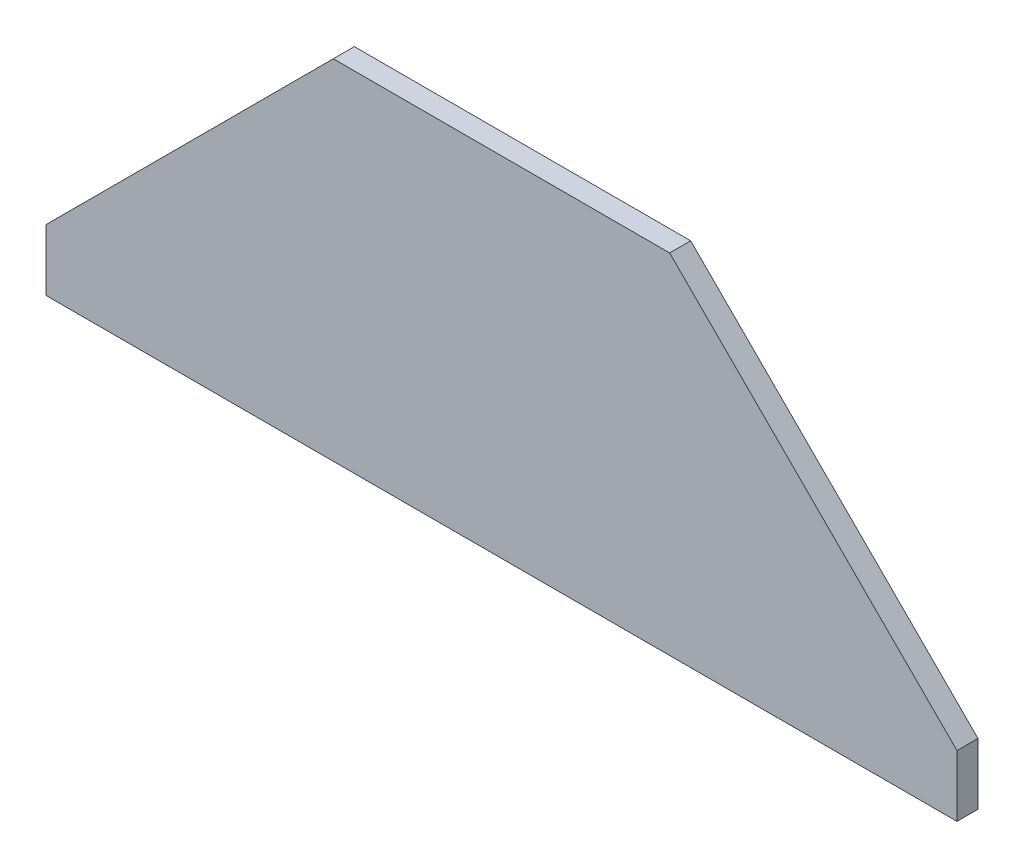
ISO-10303-21;
HEADER;
FILE_DESCRIPTION(('STEP AP214'),'2;1');
FILE_NAME('part.step','',(''),(''),'','','');
FILE_SCHEMA(('AUTOMOTIVE_DESIGN { 1 0 10303 214 1 1 1 1 }'));
ENDSEC;
DATA;
#1=APPLICATION_CONTEXT('core data for automotive mechanical design processes');
#2=APPLICATION_PROTOCOL_DEFINITION('international standard','automotive_design',2000,#1);
#3=PRODUCT_CONTEXT('',#1,'mechanical');
#4=PRODUCT('Part','Part','',(#3));
#5=PRODUCT_RELATED_PRODUCT_CATEGORY('part','',(#4));
#6=PRODUCT_DEFINITION_FORMATION('','',#4);
#7=PRODUCT_DEFINITION_CONTEXT('part definition',#1,'design');
#8=PRODUCT_DEFINITION('design','',#6,#7);
#9=PRODUCT_DEFINITION_SHAPE('','',#8);
#10=(LENGTH_UNIT() NAMED_UNIT(*) SI_UNIT(.MILLI.,.METRE.));
#11=(NAMED_UNIT(*) PLANE_ANGLE_UNIT() SI_UNIT($,.RADIAN.));
#12=(NAMED_UNIT(*) SI_UNIT($,.STERADIAN.) SOLID_ANGLE_UNIT());
#13=UNCERTAINTY_MEASURE_WITH_UNIT(LENGTH_MEASURE(1.E-05),#10,'distance_accuracy_value','');
#14=(GEOMETRIC_REPRESENTATION_CONTEXT(3) GLOBAL_UNCERTAINTY_ASSIGNED_CONTEXT((#13)) GLOBAL_UNIT_ASSIGNED_CONTEXT((#10,
#11,#12)) REPRESENTATION_CONTEXT('',''));
#15=CARTESIAN_POINT('',(0.,0.,0.));
#16=DIRECTION('',(0.,0.,1.));
#17=DIRECTION('',(1.,0.,0.));
#18=AXIS2_PLACEMENT_3D('',#15,#16,#17);
#19=CARTESIAN_POINT('',(498.999046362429,-188.642796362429,9.525));
#20=DIRECTION('',(0.707106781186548,0.707106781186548,0.));
#21=DIRECTION('',(-0.707106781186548,0.707106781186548,0.));
#22=AXIS2_PLACEMENT_3D('',#19,#20,#21);
#23=PLANE('',#22);
#24=DIRECTION('',(0.707106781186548,-0.707106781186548,0.));
#25=VECTOR('',#24,1.);
#26=CARTESIAN_POINT('',(498.999046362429,-188.642796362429,-9.525));
#27=LINE('',#26,#25);
#28=CARTESIAN_POINT('',(152.4,157.95625,-9.525));
#29=VERTEX_POINT('',#28);
#30=CARTESIAN_POINT('',(412.75,-102.39375,-9.525));
#31=VERTEX_POINT('',#30);
#32=EDGE_CURVE('E114',#29,#31,#27,.T.);
#33=ORIENTED_EDGE('',*,*,#32,.F.);
#34=DIRECTION('',(0.,0.,-1.));
#35=VECTOR('',#34,1.);
#36=CARTESIAN_POINT('',(152.4,157.95625,9.525));
#37=LINE('',#36,#35);
#38=CARTESIAN_POINT('',(152.4,157.95625,9.525));
#39=VERTEX_POINT('',#38);
#40=EDGE_CURVE('E11',#39,#29,#37,.T.);
#41=ORIENTED_EDGE('',*,*,#40,.F.);
#42=DIRECTION('',(0.707106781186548,-0.707106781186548,0.));
#43=VECTOR('',#42,1.);
#44=CARTESIAN_POINT('',(498.999046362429,-188.642796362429,9.525));
#45=LINE('',#44,#43);
#46=CARTESIAN_POINT('',(412.75,-102.39375,9.525));
#47=VERTEX_POINT('',#46);
#48=EDGE_CURVE('E127',#39,#47,#45,.T.);
#49=ORIENTED_EDGE('',*,*,#48,.T.);
#50=DIRECTION('',(0.,0.,-1.));
#51=VECTOR('',#50,1.);
#52=CARTESIAN_POINT('',(412.75,-102.39375,9.525));
#53=LINE('',#52,#51);
#54=EDGE_CURVE('E76',#47,#31,#53,.T.);
#55=ORIENTED_EDGE('',*,*,#54,.T.);
#56=EDGE_LOOP('',(#33,#41,#49,#55));
#57=FACE_BOUND('',#56,.T.);
#58=ADVANCED_FACE('F32',(#57),#23,.T.);
#59=CARTESIAN_POINT('',(1.1025825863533E-13,157.95625,9.525));
#60=DIRECTION('',(0.,1.,0.));
#61=DIRECTION('',(0.,0.,1.));
#62=AXIS2_PLACEMENT_3D('',#59,#60,#61);
#63=PLANE('',#62);
#64=DIRECTION('',(1.,0.,0.));
#65=VECTOR('',#64,1.);
#66=CARTESIAN_POINT('',(1.1025825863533E-13,157.95625,-9.525));
#67=LINE('',#66,#65);
#68=CARTESIAN_POINT('',(-152.4,157.95625,-9.525));
#69=VERTEX_POINT('',#68);
#70=EDGE_CURVE('E117',#69,#29,#67,.T.);
#71=ORIENTED_EDGE('',*,*,#70,.F.);
#72=DIRECTION('',(0.,0.,-1.));
#73=VECTOR('',#72,1.);
#74=CARTESIAN_POINT('',(-152.4,157.95625,9.525));
#75=LINE('',#74,#73);
#76=CARTESIAN_POINT('',(-152.4,157.95625,9.525));
#77=VERTEX_POINT('',#76);
#78=EDGE_CURVE('E40',#77,#69,#75,.T.);
#79=ORIENTED_EDGE('',*,*,#78,.F.);
#80=DIRECTION('',(1.,0.,0.));
#81=VECTOR('',#80,1.);
#82=CARTESIAN_POINT('',(1.1025825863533E-13,157.95625,9.525));
#83=LINE('',#82,#81);
#84=EDGE_CURVE('E109',#77,#39,#83,.T.);
#85=ORIENTED_EDGE('',*,*,#84,.T.);
#86=ORIENTED_EDGE('',*,*,#40,.T.);
#87=EDGE_LOOP('',(#71,#79,#85,#86));
#88=FACE_BOUND('',#87,.T.);
#89=ADVANCED_FACE('F136',(#88),#63,.T.);
#90=CARTESIAN_POINT('',(-498.999046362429,-188.642796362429,9.525));
#91=DIRECTION('',(-0.707106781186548,0.707106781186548,0.));
#92=DIRECTION('',(-0.707106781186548,-0.707106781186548,0.));
#93=AXIS2_PLACEMENT_3D('',#90,#91,#92);
#94=PLANE('',#93);
#95=DIRECTION('',(0.707106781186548,0.707106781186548,0.));
#96=VECTOR('',#95,1.);
#97=CARTESIAN_POINT('',(-498.999046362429,-188.642796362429,-9.525));
#98=LINE('',#97,#96);
#99=CARTESIAN_POINT('',(-412.75,-102.39375,-9.525));
#100=VERTEX_POINT('',#99);
#101=EDGE_CURVE('E120',#100,#69,#98,.T.);
#102=ORIENTED_EDGE('',*,*,#101,.F.);
#103=DIRECTION('',(0.,0.,-1.));
#104=VECTOR('',#103,1.);
#105=CARTESIAN_POINT('',(-412.75,-102.39375,9.525));
#106=LINE('',#105,#104);
#107=CARTESIAN_POINT('',(-412.75,-102.39375,9.525));
#108=VERTEX_POINT('',#107);
#109=EDGE_CURVE('E97',#108,#100,#106,.T.);
#110=ORIENTED_EDGE('',*,*,#109,.F.);
#111=DIRECTION('',(0.707106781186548,0.707106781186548,0.));
#112=VECTOR('',#111,1.);
#113=CARTESIAN_POINT('',(-498.999046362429,-188.642796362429,9.525));
#114=LINE('',#113,#112);
#115=EDGE_CURVE('E107',#108,#77,#114,.T.);
#116=ORIENTED_EDGE('',*,*,#115,.T.);
#117=ORIENTED_EDGE('',*,*,#78,.T.);
#118=EDGE_LOOP('',(#102,#110,#116,#117));
#119=FACE_BOUND('',#118,.T.);
#120=ADVANCED_FACE('F133',(#119),#94,.T.);
#121=CARTESIAN_POINT('',(-412.75,-687.641842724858,9.525));
#122=DIRECTION('',(-1.,0.,0.));
#123=DIRECTION('',(0.,0.,1.));
#124=AXIS2_PLACEMENT_3D('',#121,#122,#123);
#125=PLANE('',#124);
#126=DIRECTION('',(0.,1.,0.));
#127=VECTOR('',#126,1.);
#128=CARTESIAN_POINT('',(-412.75,-687.641842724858,-9.525));
#129=LINE('',#128,#127);
#130=CARTESIAN_POINT('',(-412.75,-157.95625,-9.525));
#131=VERTEX_POINT('',#130);
#132=EDGE_CURVE('E96',#131,#100,#129,.T.);
#133=ORIENTED_EDGE('',*,*,#132,.F.);
#134=DIRECTION('',(0.,0.,-1.));
#135=VECTOR('',#134,1.);
#136=CARTESIAN_POINT('',(-412.75,-157.95625,9.525));
#137=LINE('',#136,#135);
#138=CARTESIAN_POINT('',(-412.75,-157.95625,9.525));
#139=VERTEX_POINT('',#138);
#140=EDGE_CURVE('E90',#139,#131,#137,.T.);
#141=ORIENTED_EDGE('',*,*,#140,.F.);
#142=DIRECTION('',(0.,1.,0.));
#143=VECTOR('',#142,1.);
#144=CARTESIAN_POINT('',(-412.75,-687.641842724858,9.525));
#145=LINE('',#144,#143);
#146=EDGE_CURVE('E94',#139,#108,#145,.T.);
#147=ORIENTED_EDGE('',*,*,#146,.T.);
#148=ORIENTED_EDGE('',*,*,#109,.T.);
#149=EDGE_LOOP('',(#133,#141,#147,#148));
#150=FACE_BOUND('',#149,.T.);
#151=ADVANCED_FACE('F92',(#150),#125,.T.);
#152=CARTESIAN_POINT('',(1.1025825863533E-13,-157.95625,9.525));
#153=DIRECTION('',(0.,1.,0.));
#154=DIRECTION('',(0.,0.,1.));
#155=AXIS2_PLACEMENT_3D('',#152,#153,#154);
#156=PLANE('',#155);
#157=DIRECTION('',(1.,0.,0.));
#158=VECTOR('',#157,1.);
#159=CARTESIAN_POINT('',(1.1025825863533E-13,-157.95625,-9.525));
#160=LINE('',#159,#158);
#161=CARTESIAN_POINT('',(412.75,-157.95625,-9.525));
#162=VERTEX_POINT('',#161);
#163=EDGE_CURVE('E69',#131,#162,#160,.T.);
#164=ORIENTED_EDGE('',*,*,#163,.T.);
#165=DIRECTION('',(0.,0.,-1.));
#166=VECTOR('',#165,1.);
#167=CARTESIAN_POINT('',(412.75,-157.95625,9.525));
#168=LINE('',#167,#166);
#169=CARTESIAN_POINT('',(412.75,-157.95625,9.525));
#170=VERTEX_POINT('',#169);
#171=EDGE_CURVE('E98',#170,#162,#168,.T.);
#172=ORIENTED_EDGE('',*,*,#171,.F.);
#173=DIRECTION('',(1.,0.,0.));
#174=VECTOR('',#173,1.);
#175=CARTESIAN_POINT('',(1.1025825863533E-13,-157.95625,9.525));
#176=LINE('',#175,#174);
#177=EDGE_CURVE('E100',#139,#170,#176,.T.);
#178=ORIENTED_EDGE('',*,*,#177,.F.);
#179=ORIENTED_EDGE('',*,*,#140,.T.);
#180=EDGE_LOOP('',(#164,#172,#178,#179));
#181=FACE_BOUND('',#180,.T.);
#182=ADVANCED_FACE('F101',(#181),#156,.F.);
#183=CARTESIAN_POINT('',(412.75,-687.641842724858,9.525));
#184=DIRECTION('',(-1.,0.,0.));
#185=DIRECTION('',(0.,0.,1.));
#186=AXIS2_PLACEMENT_3D('',#183,#184,#185);
#187=PLANE('',#186);
#188=DIRECTION('',(0.,1.,0.));
#189=VECTOR('',#188,1.);
#190=CARTESIAN_POINT('',(412.75,-687.641842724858,-9.525));
#191=LINE('',#190,#189);
#192=EDGE_CURVE('E125',#162,#31,#191,.T.);
#193=ORIENTED_EDGE('',*,*,#192,.T.);
#194=ORIENTED_EDGE('',*,*,#54,.F.);
#195=DIRECTION('',(0.,1.,0.));
#196=VECTOR('',#195,1.);
#197=CARTESIAN_POINT('',(412.75,-687.641842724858,9.525));
#198=LINE('',#197,#196);
#199=EDGE_CURVE('E48',#170,#47,#198,.T.);
#200=ORIENTED_EDGE('',*,*,#199,.F.);
#201=ORIENTED_EDGE('',*,*,#171,.T.);
#202=EDGE_LOOP('',(#193,#194,#200,#201));
#203=FACE_BOUND('',#202,.T.);
#204=ADVANCED_FACE('F141',(#203),#187,.F.);
#205=CARTESIAN_POINT('',(1.1025825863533E-13,-687.641842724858,9.525));
#206=DIRECTION('',(0.,0.,1.));
#207=DIRECTION('',(1.,0.,0.));
#208=AXIS2_PLACEMENT_3D('',#205,#206,#207);
#209=PLANE('',#208);
#210=ORIENTED_EDGE('',*,*,#48,.F.);
#211=ORIENTED_EDGE('',*,*,#84,.F.);
#212=ORIENTED_EDGE('',*,*,#115,.F.);
#213=ORIENTED_EDGE('',*,*,#146,.F.);
#214=ORIENTED_EDGE('',*,*,#177,.T.);
#215=ORIENTED_EDGE('',*,*,#199,.T.);
#216=EDGE_LOOP('',(#210,#211,#212,#213,#214,#215));
#217=FACE_BOUND('',#216,.T.);
#218=ADVANCED_FACE('F104',(#217),#209,.T.);
#219=CARTESIAN_POINT('',(1.1025825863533E-13,-687.641842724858,-9.525));
#220=DIRECTION('',(0.,0.,1.));
#221=DIRECTION('',(1.,0.,0.));
#222=AXIS2_PLACEMENT_3D('',#219,#220,#221);
#223=PLANE('',#222);
#224=ORIENTED_EDGE('',*,*,#32,.T.);
#225=ORIENTED_EDGE('',*,*,#192,.F.);
#226=ORIENTED_EDGE('',*,*,#163,.F.);
#227=ORIENTED_EDGE('',*,*,#132,.T.);
#228=ORIENTED_EDGE('',*,*,#101,.T.);
#229=ORIENTED_EDGE('',*,*,#70,.T.);
#230=EDGE_LOOP('',(#224,#225,#226,#227,#228,#229));
#231=FACE_BOUND('',#230,.T.);
#232=ADVANCED_FACE('F138',(#231),#223,.F.);
#233=CLOSED_SHELL('',(#58,#89,#120,#151,#182,#204,#218,#232));
#234=MANIFOLD_SOLID_BREP('B2',#233);
#235=ADVANCED_BREP_SHAPE_REPRESENTATION('',(#18,#234),#14);
#236=SHAPE_DEFINITION_REPRESENTATION(#9,#235);
ENDSEC;
END-ISO-10303-21;
